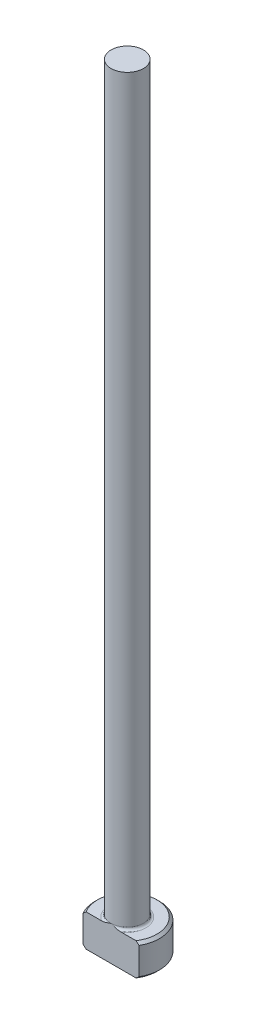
ISO-10303-21;
HEADER;
FILE_DESCRIPTION(('STEP AP214'),'2;1');
FILE_NAME('part.step','',(''),(''),'','','');
FILE_SCHEMA(('AUTOMOTIVE_DESIGN { 1 0 10303 214 1 1 1 1 }'));
ENDSEC;
DATA;
#1=APPLICATION_CONTEXT('core data for automotive mechanical design processes');
#2=APPLICATION_PROTOCOL_DEFINITION('international standard','automotive_design',2000,#1);
#3=PRODUCT_CONTEXT('',#1,'mechanical');
#4=PRODUCT('Part','Part','',(#3));
#5=PRODUCT_RELATED_PRODUCT_CATEGORY('part','',(#4));
#6=PRODUCT_DEFINITION_FORMATION('','',#4);
#7=PRODUCT_DEFINITION_CONTEXT('part definition',#1,'design');
#8=PRODUCT_DEFINITION('design','',#6,#7);
#9=PRODUCT_DEFINITION_SHAPE('','',#8);
#10=(LENGTH_UNIT() NAMED_UNIT(*) SI_UNIT(.MILLI.,.METRE.));
#11=(NAMED_UNIT(*) PLANE_ANGLE_UNIT() SI_UNIT($,.RADIAN.));
#12=(NAMED_UNIT(*) SI_UNIT($,.STERADIAN.) SOLID_ANGLE_UNIT());
#13=UNCERTAINTY_MEASURE_WITH_UNIT(LENGTH_MEASURE(1.E-05),#10,'distance_accuracy_value','');
#14=(GEOMETRIC_REPRESENTATION_CONTEXT(3) GLOBAL_UNCERTAINTY_ASSIGNED_CONTEXT((#13)) GLOBAL_UNIT_ASSIGNED_CONTEXT((#10,
#11,#12)) REPRESENTATION_CONTEXT('',''));
#15=CARTESIAN_POINT('',(0.,0.,0.));
#16=DIRECTION('',(0.,0.,1.));
#17=DIRECTION('',(1.,0.,0.));
#18=AXIS2_PLACEMENT_3D('',#15,#16,#17);
#19=CARTESIAN_POINT('',(0.,0.,0.));
#20=DIRECTION('',(0.,-1.,0.));
#21=DIRECTION('',(0.,0.,-1.));
#22=AXIS2_PLACEMENT_3D('',#19,#20,#21);
#23=PLANE('',#22);
#24=CARTESIAN_POINT('',(0.,0.,0.));
#25=DIRECTION('',(0.,-1.,0.));
#26=DIRECTION('',(0.,0.,-1.));
#27=AXIS2_PLACEMENT_3D('',#24,#25,#26);
#28=CIRCLE('',#27,2.92099999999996);
#29=CARTESIAN_POINT('',(-2.45195529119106,0.,1.58749999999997));
#30=VERTEX_POINT('',#29);
#31=CARTESIAN_POINT('',(2.45195529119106,0.,1.58749999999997));
#32=VERTEX_POINT('',#31);
#33=EDGE_CURVE('E98',#30,#32,#28,.T.);
#34=ORIENTED_EDGE('',*,*,#33,.T.);
#35=DIRECTION('',(-1.,0.,0.));
#36=VECTOR('',#35,1.);
#37=CARTESIAN_POINT('',(-2.74963065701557,0.,1.58749999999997));
#38=LINE('',#37,#36);
#39=EDGE_CURVE('E83',#32,#30,#38,.T.);
#40=ORIENTED_EDGE('',*,*,#39,.T.);
#41=EDGE_LOOP('',(#34,#40));
#42=FACE_BOUND('',#41,.T.);
#43=ADVANCED_FACE('F32',(#42),#23,.T.);
#44=CARTESIAN_POINT('',(0.,259.958771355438,0.));
#45=DIRECTION('',(0.,1.,0.));
#46=DIRECTION('',(0.,0.,1.));
#47=AXIS2_PLACEMENT_3D('',#44,#45,#46);
#48=CYLINDRICAL_SURFACE('',#47,3.17499999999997);
#49=CARTESIAN_POINT('',(0.,2.92099999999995,0.));
#50=DIRECTION('',(0.,1.,0.));
#51=DIRECTION('',(0.,0.,1.));
#52=AXIS2_PLACEMENT_3D('',#49,#50,#51);
#53=CIRCLE('',#52,3.17499999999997);
#54=CARTESIAN_POINT('',(-2.74963065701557,2.92099999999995,1.58749999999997));
#55=VERTEX_POINT('',#54);
#56=CARTESIAN_POINT('',(2.74963065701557,2.92099999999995,1.58749999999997));
#57=VERTEX_POINT('',#56);
#58=EDGE_CURVE('E104',#55,#57,#53,.F.);
#59=ORIENTED_EDGE('',*,*,#58,.T.);
#60=DIRECTION('',(0.,-1.,0.));
#61=VECTOR('',#60,1.);
#62=CARTESIAN_POINT('',(2.74963065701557,76.2,1.58749999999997));
#63=LINE('',#62,#61);
#64=CARTESIAN_POINT('',(2.74963065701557,0.254000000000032,1.58749999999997));
#65=VERTEX_POINT('',#64);
#66=EDGE_CURVE('E183',#57,#65,#63,.T.);
#67=ORIENTED_EDGE('',*,*,#66,.T.);
#68=CARTESIAN_POINT('',(0.,0.254000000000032,0.));
#69=DIRECTION('',(0.,-1.,0.));
#70=DIRECTION('',(0.,0.,-1.));
#71=AXIS2_PLACEMENT_3D('',#68,#69,#70);
#72=CIRCLE('',#71,3.17499999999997);
#73=CARTESIAN_POINT('',(-2.74963065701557,0.254000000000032,1.58749999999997));
#74=VERTEX_POINT('',#73);
#75=EDGE_CURVE('E100',#65,#74,#72,.F.);
#76=ORIENTED_EDGE('',*,*,#75,.T.);
#77=DIRECTION('',(0.,-1.,0.));
#78=VECTOR('',#77,1.);
#79=CARTESIAN_POINT('',(-2.74963065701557,76.2,1.58749999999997));
#80=LINE('',#79,#78);
#81=EDGE_CURVE('E93',#55,#74,#80,.T.);
#82=ORIENTED_EDGE('',*,*,#81,.F.);
#83=EDGE_LOOP('',(#59,#67,#76,#82));
#84=FACE_BOUND('',#83,.T.);
#85=ADVANCED_FACE('F158',(#84),#48,.T.);
#86=CARTESIAN_POINT('',(-3.17499999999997,3.175,0.));
#87=DIRECTION('',(0.,1.,0.));
#88=DIRECTION('',(0.,0.,1.));
#89=AXIS2_PLACEMENT_3D('',#86,#87,#88);
#90=PLANE('',#89);
#91=CARTESIAN_POINT('',(0.,3.175,0.));
#92=DIRECTION('',(0.,1.,0.));
#93=DIRECTION('',(0.,0.,1.));
#94=AXIS2_PLACEMENT_3D('',#91,#92,#93);
#95=CIRCLE('',#94,2.92099999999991);
#96=CARTESIAN_POINT('',(2.45195529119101,3.175,1.58749999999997));
#97=VERTEX_POINT('',#96);
#98=CARTESIAN_POINT('',(-2.45195529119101,3.175,1.58749999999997));
#99=VERTEX_POINT('',#98);
#100=EDGE_CURVE('E178',#97,#99,#95,.T.);
#101=ORIENTED_EDGE('',*,*,#100,.T.);
#102=DIRECTION('',(1.,0.,0.));
#103=VECTOR('',#102,1.);
#104=CARTESIAN_POINT('',(-3.17499999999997,3.175,1.58749999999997));
#105=LINE('',#104,#103);
#106=CARTESIAN_POINT('',(-0.933255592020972,3.17500000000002,1.58749999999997));
#107=VERTEX_POINT('',#106);
#108=EDGE_CURVE('E57',#99,#107,#105,.T.);
#109=ORIENTED_EDGE('',*,*,#108,.T.);
#110=CARTESIAN_POINT('',(0.,3.175,0.));
#111=DIRECTION('',(0.,1.,0.));
#112=DIRECTION('',(0.,0.,1.));
#113=AXIS2_PLACEMENT_3D('',#110,#111,#112);
#114=CIRCLE('',#113,1.84149999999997);
#115=CARTESIAN_POINT('',(0.933255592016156,3.17500000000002,1.58749999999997));
#116=VERTEX_POINT('',#115);
#117=EDGE_CURVE('E107',#107,#116,#114,.F.);
#118=ORIENTED_EDGE('',*,*,#117,.T.);
#119=EDGE_CURVE('E136',#116,#97,#105,.T.);
#120=ORIENTED_EDGE('',*,*,#119,.T.);
#121=EDGE_LOOP('',(#101,#109,#118,#120));
#122=FACE_BOUND('',#121,.T.);
#123=ADVANCED_FACE('F147',(#122),#90,.T.);
#124=CARTESIAN_POINT('',(0.,3.17499999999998,0.));
#125=DIRECTION('',(0.,-1.,0.));
#126=DIRECTION('',(0.,0.,-1.));
#127=AXIS2_PLACEMENT_3D('',#124,#125,#126);
#128=CONICAL_SURFACE('',#127,2.92099999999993,0.78539816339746);
#129=ORIENTED_EDGE('',*,*,#58,.F.);
#130=CARTESIAN_POINT('',(-6.0529050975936,-0.161620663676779,1.58749999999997));
#131=CARTESIAN_POINT('',(-5.91567682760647,-0.028889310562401,1.58749999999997));
#132=CARTESIAN_POINT('',(-5.77831035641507,0.103699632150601,1.58749999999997));
#133=CARTESIAN_POINT('',(-5.50321874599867,0.36850839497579,1.58749999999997));
#134=CARTESIAN_POINT('',(-5.36549360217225,0.500728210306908,1.58749999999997));
#135=CARTESIAN_POINT('',(-5.08953516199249,0.764778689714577,1.58749999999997));
#136=CARTESIAN_POINT('',(-4.95130164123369,0.896609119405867,1.58749999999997));
#137=CARTESIAN_POINT('',(-4.67428233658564,1.15968706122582,1.58749999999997));
#138=CARTESIAN_POINT('',(-4.5354965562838,1.29093457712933,1.58749999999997));
#139=CARTESIAN_POINT('',(-4.2599772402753,1.550077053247,1.58749999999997));
#140=CARTESIAN_POINT('',(-4.12325766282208,1.67798684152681,1.58749999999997));
#141=CARTESIAN_POINT('',(-3.84892898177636,1.9328486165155,1.58749999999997));
#142=CARTESIAN_POINT('',(-3.71131988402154,2.05980060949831,1.58749999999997));
#143=CARTESIAN_POINT('',(-3.43493978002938,2.31237508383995,1.58749999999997));
#144=CARTESIAN_POINT('',(-3.29616903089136,2.4379978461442,1.58749999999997));
#145=CARTESIAN_POINT('',(-3.01699558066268,2.68741369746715,1.58749999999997));
#146=CARTESIAN_POINT('',(-2.8765929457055,2.81120686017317,1.58749999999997));
#147=CARTESIAN_POINT('',(-2.64816703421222,3.0087586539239,1.58749999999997));
#148=CARTESIAN_POINT('',(-2.56087478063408,3.08336151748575,1.58749999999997));
#149=CARTESIAN_POINT('',(-2.38515423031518,3.23123871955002,1.58749999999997));
#150=CARTESIAN_POINT('',(-2.29672582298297,3.30451292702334,1.58749999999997));
#151=CARTESIAN_POINT('',(-2.11747400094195,3.45004422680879,1.58749999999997));
#152=CARTESIAN_POINT('',(-2.02663514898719,3.52228237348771,1.58749999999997));
#153=CARTESIAN_POINT('',(-1.84302524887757,3.664230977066,1.58749999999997));
#154=CARTESIAN_POINT('',(-1.75025467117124,3.73394203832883,1.58749999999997));
#155=CARTESIAN_POINT('',(-1.5606747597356,3.8708063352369,1.58749999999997));
#156=CARTESIAN_POINT('',(-1.46382547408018,3.93790459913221,1.58749999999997));
#157=CARTESIAN_POINT('',(-1.26632594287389,4.06669147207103,1.58749999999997));
#158=CARTESIAN_POINT('',(-1.16567073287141,4.12837264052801,1.58749999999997));
#159=CARTESIAN_POINT('',(-1.01165766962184,4.2140225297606,1.58749999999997));
#160=CARTESIAN_POINT('',(-0.960142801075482,4.24127929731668,1.58749999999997));
#161=CARTESIAN_POINT('',(-0.855780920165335,4.29309798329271,1.58749999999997));
#162=CARTESIAN_POINT('',(-0.802933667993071,4.31765941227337,1.58749999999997));
#163=CARTESIAN_POINT('',(-0.642461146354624,4.38614656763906,1.58749999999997));
#164=CARTESIAN_POINT('',(-0.53251850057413,4.42510149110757,1.58749999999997));
#165=CARTESIAN_POINT('',(-0.367680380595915,4.46726244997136,1.58749999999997));
#166=CARTESIAN_POINT('',(-0.314802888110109,4.47844427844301,1.58749999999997));
#167=CARTESIAN_POINT('',(-0.208209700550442,4.49576654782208,1.58749999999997));
#168=CARTESIAN_POINT('',(-0.154494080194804,4.50190743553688,1.58749999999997));
#169=CARTESIAN_POINT('',(-0.0468792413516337,4.50871296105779,1.58749999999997));
#170=CARTESIAN_POINT('',(0.00701889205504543,4.50939451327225,1.58749999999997));
#171=CARTESIAN_POINT('',(0.114606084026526,4.50527679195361,1.58749999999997));
#172=CARTESIAN_POINT('',(0.168295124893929,4.50047706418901,1.58749999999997));
#173=CARTESIAN_POINT('',(0.274485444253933,4.48579689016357,1.58749999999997));
#174=CARTESIAN_POINT('',(0.326992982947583,4.4759608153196,1.58749999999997));
#175=CARTESIAN_POINT('',(0.430974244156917,4.45181809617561,1.58749999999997));
#176=CARTESIAN_POINT('',(0.482447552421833,4.43750969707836,1.58749999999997));
#177=CARTESIAN_POINT('',(0.584460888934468,4.40502489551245,1.58749999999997));
#178=CARTESIAN_POINT('',(0.634994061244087,4.38682724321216,1.58749999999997));
#179=CARTESIAN_POINT('',(0.73478943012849,4.34729308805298,1.58749999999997));
#180=CARTESIAN_POINT('',(0.784051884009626,4.32595722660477,1.58749999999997));
#181=CARTESIAN_POINT('',(0.93054934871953,4.25791922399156,1.58749999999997));
#182=CARTESIAN_POINT('',(1.02598802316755,4.20736047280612,1.58749999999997));
#183=CARTESIAN_POINT('',(1.21304313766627,4.09955451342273,1.58749999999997));
#184=CARTESIAN_POINT('',(1.30465471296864,4.04229912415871,1.58749999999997));
#185=CARTESIAN_POINT('',(1.48526211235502,3.92308746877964,1.58749999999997));
#186=CARTESIAN_POINT('',(1.57424615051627,3.86111349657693,1.58749999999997));
#187=CARTESIAN_POINT('',(1.7499000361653,3.73408621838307,1.58749999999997));
#188=CARTESIAN_POINT('',(1.83657099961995,3.6690344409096,1.58749999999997));
#189=CARTESIAN_POINT('',(2.0093176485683,3.5358337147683,1.58749999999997));
#190=CARTESIAN_POINT('',(2.09537048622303,3.46765527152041,1.58749999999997));
#191=CARTESIAN_POINT('',(2.26611736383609,3.32960643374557,1.58749999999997));
#192=CARTESIAN_POINT('',(2.3508112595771,3.25973586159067,1.58749999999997));
#193=CARTESIAN_POINT('',(2.60290121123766,3.04858139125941,1.58749999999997));
#194=CARTESIAN_POINT('',(2.76872537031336,2.9054238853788,1.58749999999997));
#195=CARTESIAN_POINT('',(3.06970913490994,2.64069522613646,1.58749999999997));
#196=CARTESIAN_POINT('',(3.20528660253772,2.51959458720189,1.58749999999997));
#197=CARTESIAN_POINT('',(3.475103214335,2.27590400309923,1.58749999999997));
#198=CARTESIAN_POINT('',(3.60934232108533,2.15331401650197,1.58749999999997));
#199=CARTESIAN_POINT('',(3.87695374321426,1.90694239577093,1.58749999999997));
#200=CARTESIAN_POINT('',(4.01032512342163,1.78315974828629,1.58749999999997));
#201=CARTESIAN_POINT('',(4.27630880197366,1.53478104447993,1.58749999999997));
#202=CARTESIAN_POINT('',(4.40892109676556,1.41018498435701,1.58749999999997));
#203=CARTESIAN_POINT('',(4.7949941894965,1.04574684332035,1.58749999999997));
#204=CARTESIAN_POINT('',(5.04767313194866,0.805076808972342,1.58749999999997));
#205=CARTESIAN_POINT('',(5.42550911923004,0.443121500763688,1.58749999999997));
#206=CARTESIAN_POINT('',(5.55118772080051,0.322378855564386,1.58749999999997));
#207=CARTESIAN_POINT('',(5.80225207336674,0.0805914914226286,1.58749999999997));
#208=CARTESIAN_POINT('',(5.92763782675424,-0.0404532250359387,1.58749999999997));
#209=CARTESIAN_POINT('',(6.0529050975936,-0.16162066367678,1.58749999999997));
#210=B_SPLINE_CURVE_WITH_KNOTS('',3,(#130,#131,#132,#133,#134,#135,#136,#137,#138,#139,#140,
#141,#142,#143,#144,#145,#146,#147,#148,#149,#150,#151,#152,#153,#154,#155,#156,#157,#158,#159,
#160,#161,#162,#163,#164,#165,#166,#167,#168,#169,#170,#171,#172,#173,#174,#175,#176,#177,#178,
#179,#180,#181,#182,#183,#184,#185,#186,#187,#188,#189,#190,#191,#192,#193,#194,#195,#196,#197,
#198,#199,#200,#201,#202,#203,#204,#205,#206,#207,#208,#209),.UNSPECIFIED.,.F.,.F.,(4,2,2,2,2,2,
2,2,2,2,2,2,2,2,2,2,2,2,2,2,2,2,2,2,2,2,2,2,2,2,2,2,2,2,2,2,2,2,2,4),(0.,0.57275067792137,
1.14550874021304,1.71856057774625,2.29160869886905,2.85328006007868,3.41494773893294,
3.97649423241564,4.53801804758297,4.88249307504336,5.22700189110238,5.57515326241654,
5.92322081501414,6.27657800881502,6.63041319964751,6.8051812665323,6.97998101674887,
7.32824262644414,7.49018491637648,7.65211285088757,7.81353889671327,7.97497832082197,
8.13501929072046,8.29512313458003,8.4561251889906,8.61709438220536,8.940629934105,
9.26456495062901,9.58978187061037,9.91483894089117,10.2441741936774,10.5735441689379,
11.2306812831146,11.7760337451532,12.3214014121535,12.8672825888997,13.4131663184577,
14.4600164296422,14.9828595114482,15.5056983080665),.UNSPECIFIED.);
#211=EDGE_CURVE('E135',#55,#99,#210,.T.);
#212=ORIENTED_EDGE('',*,*,#211,.T.);
#213=ORIENTED_EDGE('',*,*,#100,.F.);
#214=EDGE_CURVE('E127',#97,#57,#210,.T.);
#215=ORIENTED_EDGE('',*,*,#214,.T.);
#216=EDGE_LOOP('',(#129,#212,#213,#215));
#217=FACE_BOUND('',#216,.T.);
#218=ADVANCED_FACE('F143',(#217),#128,.T.);
#219=CARTESIAN_POINT('',(0.,0.254000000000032,0.));
#220=DIRECTION('',(0.,1.,0.));
#221=DIRECTION('',(0.,0.,1.));
#222=AXIS2_PLACEMENT_3D('',#219,#220,#221);
#223=CONICAL_SURFACE('',#222,3.17499999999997,0.785398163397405);
#224=ORIENTED_EDGE('',*,*,#75,.F.);
#225=CARTESIAN_POINT('',(6.0529050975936,3.3366206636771,1.58749999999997));
#226=CARTESIAN_POINT('',(5.91567682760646,3.2038893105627,1.58749999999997));
#227=CARTESIAN_POINT('',(5.77831035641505,3.07130036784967,1.58749999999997));
#228=CARTESIAN_POINT('',(5.50321874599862,2.80649160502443,1.58749999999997));
#229=CARTESIAN_POINT('',(5.36549360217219,2.67427178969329,1.58749999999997));
#230=CARTESIAN_POINT('',(5.08953516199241,2.41022131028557,1.58749999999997));
#231=CARTESIAN_POINT('',(4.9513016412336,2.27839088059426,1.58749999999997));
#232=CARTESIAN_POINT('',(4.67428233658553,2.01531293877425,1.58749999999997));
#233=CARTESIAN_POINT('',(4.53549655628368,1.88406542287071,1.58749999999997));
#234=CARTESIAN_POINT('',(4.25997724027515,1.62492294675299,1.58749999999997));
#235=CARTESIAN_POINT('',(4.12325766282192,1.49701315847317,1.58749999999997));
#236=CARTESIAN_POINT('',(3.84892898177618,1.24215138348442,1.58749999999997));
#237=CARTESIAN_POINT('',(3.71131988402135,1.1151993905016,1.58749999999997));
#238=CARTESIAN_POINT('',(3.43493978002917,0.862624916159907,1.58749999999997));
#239=CARTESIAN_POINT('',(3.29616903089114,0.737002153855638,1.58749999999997));
#240=CARTESIAN_POINT('',(3.01699558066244,0.487586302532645,1.58749999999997));
#241=CARTESIAN_POINT('',(2.87659294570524,0.363793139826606,1.58749999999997));
#242=CARTESIAN_POINT('',(2.64816703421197,0.16624134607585,1.58749999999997));
#243=CARTESIAN_POINT('',(2.56087478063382,0.0916384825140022,1.58749999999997));
#244=CARTESIAN_POINT('',(2.38515423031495,-0.0562387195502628,1.58749999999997));
#245=CARTESIAN_POINT('',(2.29672582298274,-0.129512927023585,1.58749999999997));
#246=CARTESIAN_POINT('',(2.11747400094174,-0.275044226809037,1.58749999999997));
#247=CARTESIAN_POINT('',(2.02663514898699,-0.34728237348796,1.58749999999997));
#248=CARTESIAN_POINT('',(1.84302524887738,-0.489230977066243,1.58749999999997));
#249=CARTESIAN_POINT('',(1.75025467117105,-0.558942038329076,1.58749999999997));
#250=CARTESIAN_POINT('',(1.56067475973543,-0.695806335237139,1.58749999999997));
#251=CARTESIAN_POINT('',(1.46382547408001,-0.762904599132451,1.58749999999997));
#252=CARTESIAN_POINT('',(1.26632594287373,-0.891691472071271,1.58749999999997));
#253=CARTESIAN_POINT('',(1.16567073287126,-0.953372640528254,1.58749999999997));
#254=CARTESIAN_POINT('',(1.01165766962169,-1.03902252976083,1.58749999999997));
#255=CARTESIAN_POINT('',(0.96014280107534,-1.06627929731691,1.58749999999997));
#256=CARTESIAN_POINT('',(0.855780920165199,-1.11809798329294,1.58749999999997));
#257=CARTESIAN_POINT('',(0.802933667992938,-1.14265941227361,1.58749999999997));
#258=CARTESIAN_POINT('',(0.642461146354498,-1.21114656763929,1.58749999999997));
#259=CARTESIAN_POINT('',(0.532518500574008,-1.2501014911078,1.58749999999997));
#260=CARTESIAN_POINT('',(0.367680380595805,-1.29226244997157,1.58749999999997));
#261=CARTESIAN_POINT('',(0.314802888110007,-1.30344427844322,1.58749999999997));
#262=CARTESIAN_POINT('',(0.208209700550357,-1.32076654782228,1.58749999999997));
#263=CARTESIAN_POINT('',(0.154494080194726,-1.32690743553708,1.58749999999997));
#264=CARTESIAN_POINT('',(0.0468792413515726,-1.33371296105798,1.58749999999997));
#265=CARTESIAN_POINT('',(-0.00701889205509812,-1.33439451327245,1.58749999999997));
#266=CARTESIAN_POINT('',(-0.114606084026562,-1.3302767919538,1.58749999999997));
#267=CARTESIAN_POINT('',(-0.168295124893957,-1.3254770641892,1.58749999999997));
#268=CARTESIAN_POINT('',(-0.274485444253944,-1.31079689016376,1.58749999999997));
#269=CARTESIAN_POINT('',(-0.326992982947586,-1.30096081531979,1.58749999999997));
#270=CARTESIAN_POINT('',(-0.430974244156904,-1.2768180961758,1.58749999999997));
#271=CARTESIAN_POINT('',(-0.482447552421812,-1.26250969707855,1.58749999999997));
#272=CARTESIAN_POINT('',(-0.584460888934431,-1.23002489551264,1.58749999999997));
#273=CARTESIAN_POINT('',(-0.634994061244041,-1.21182724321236,1.58749999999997));
#274=CARTESIAN_POINT('',(-0.734789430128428,-1.17229308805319,1.58749999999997));
#275=CARTESIAN_POINT('',(-0.784051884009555,-1.15095722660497,1.58749999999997));
#276=CARTESIAN_POINT('',(-0.930549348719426,-1.08291922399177,1.58749999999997));
#277=CARTESIAN_POINT('',(-1.02598802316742,-1.03236047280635,1.58749999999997));
#278=CARTESIAN_POINT('',(-1.21304313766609,-0.924554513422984,1.58749999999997));
#279=CARTESIAN_POINT('',(-1.30465471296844,-0.867299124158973,1.58749999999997));
#280=CARTESIAN_POINT('',(-1.48526211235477,-0.748087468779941,1.58749999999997));
#281=CARTESIAN_POINT('',(-1.574246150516,-0.686113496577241,1.58749999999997));
#282=CARTESIAN_POINT('',(-1.74990003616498,-0.559086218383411,1.58749999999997));
#283=CARTESIAN_POINT('',(-1.83657099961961,-0.494034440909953,1.58749999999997));
#284=CARTESIAN_POINT('',(-2.00931764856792,-0.360833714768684,1.58749999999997));
#285=CARTESIAN_POINT('',(-2.09537048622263,-0.292655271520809,1.58749999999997));
#286=CARTESIAN_POINT('',(-2.26611736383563,-0.154606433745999,1.58749999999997));
#287=CARTESIAN_POINT('',(-2.35081125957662,-0.0847358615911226,1.58749999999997));
#288=CARTESIAN_POINT('',(-2.60290121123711,0.126418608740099,1.58749999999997));
#289=CARTESIAN_POINT('',(-2.76872537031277,0.26957611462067,1.58749999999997));
#290=CARTESIAN_POINT('',(-3.06970913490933,0.534304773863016,1.58749999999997));
#291=CARTESIAN_POINT('',(-3.20528660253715,0.655405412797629,1.58749999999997));
#292=CARTESIAN_POINT('',(-3.47510321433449,0.89909599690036,1.58749999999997));
#293=CARTESIAN_POINT('',(-3.60934232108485,1.02168598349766,1.58749999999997));
#294=CARTESIAN_POINT('',(-3.87695374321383,1.26805760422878,1.58749999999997));
#295=CARTESIAN_POINT('',(-4.01032512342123,1.39184025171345,1.58749999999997));
#296=CARTESIAN_POINT('',(-4.27630880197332,1.64021895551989,1.58749999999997));
#297=CARTESIAN_POINT('',(-4.40892109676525,1.76481501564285,1.58749999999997));
#298=CARTESIAN_POINT('',(-4.79499418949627,2.12925315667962,1.58749999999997));
#299=CARTESIAN_POINT('',(-5.04767313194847,2.3699231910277,1.58749999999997));
#300=CARTESIAN_POINT('',(-5.42550911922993,2.73187849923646,1.58749999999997));
#301=CARTESIAN_POINT('',(-5.55118772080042,2.8526211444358,1.58749999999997));
#302=CARTESIAN_POINT('',(-5.80225207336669,3.09440850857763,1.58749999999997));
#303=CARTESIAN_POINT('',(-5.92763782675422,3.21545322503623,1.58749999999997));
#304=CARTESIAN_POINT('',(-6.0529050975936,3.33662066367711,1.58749999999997));
#305=B_SPLINE_CURVE_WITH_KNOTS('',3,(#225,#226,#227,#228,#229,#230,#231,#232,#233,#234,#235,
#236,#237,#238,#239,#240,#241,#242,#243,#244,#245,#246,#247,#248,#249,#250,#251,#252,#253,#254,
#255,#256,#257,#258,#259,#260,#261,#262,#263,#264,#265,#266,#267,#268,#269,#270,#271,#272,#273,
#274,#275,#276,#277,#278,#279,#280,#281,#282,#283,#284,#285,#286,#287,#288,#289,#290,#291,#292,
#293,#294,#295,#296,#297,#298,#299,#300,#301,#302,#303,#304),.UNSPECIFIED.,.F.,.F.,(4,2,2,2,2,2,
2,2,2,2,2,2,2,2,2,2,2,2,2,2,2,2,2,2,2,2,2,2,2,2,2,2,2,2,2,2,2,2,2,4),(0.,0.572750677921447,
1.1455087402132,1.71856057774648,2.29160869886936,2.85328006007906,3.41494773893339,
3.97649423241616,4.53801804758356,4.88249307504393,5.22700189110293,5.57515326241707,
5.92322081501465,6.27657800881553,6.630413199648,6.80518126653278,6.97998101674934,
7.3282426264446,7.49018491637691,7.65211285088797,7.81353889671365,7.97497832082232,
8.13501929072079,8.29512313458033,8.45612518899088,8.61709438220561,8.94062993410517,
9.2645649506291,9.58978187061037,9.9148389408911,10.2441741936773,10.5735441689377,
11.2306812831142,11.7760337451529,12.3214014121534,12.8672825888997,13.4131663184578,
14.4600164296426,14.9828595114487,15.5056983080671),.UNSPECIFIED.);
#306=EDGE_CURVE('E86',#65,#32,#305,.T.);
#307=ORIENTED_EDGE('',*,*,#306,.T.);
#308=ORIENTED_EDGE('',*,*,#33,.F.);
#309=EDGE_CURVE('E89',#30,#74,#305,.T.);
#310=ORIENTED_EDGE('',*,*,#309,.T.);
#311=EDGE_LOOP('',(#224,#307,#308,#310));
#312=FACE_BOUND('',#311,.T.);
#313=ADVANCED_FACE('F97',(#312),#223,.T.);
#314=CARTESIAN_POINT('',(0.,3.42900000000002,0.));
#315=DIRECTION('',(0.,1.,0.));
#316=DIRECTION('',(0.,0.,1.));
#317=AXIS2_PLACEMENT_3D('',#314,#315,#316);
#318=TOROIDAL_SURFACE('',#317,1.84149999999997,0.254);
#319=CARTESIAN_POINT('',(0.,3.42900000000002,1.58749999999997));
#320=CARTESIAN_POINT('',(1.92205032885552E-10,3.42900057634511,1.58749999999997));
#321=CARTESIAN_POINT('',(1.22611616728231E-07,3.42900115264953,1.58749999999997));
#322=CARTESIAN_POINT('',(5.09676370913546E-07,3.42900226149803,1.58749999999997));
#323=CARTESIAN_POINT('',(7.78176335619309E-07,3.42900279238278,1.58749999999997));
#324=CARTESIAN_POINT('',(1.42307273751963E-06,3.42900385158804,1.58749999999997));
#325=CARTESIAN_POINT('',(1.8071386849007E-06,3.42900437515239,1.58749999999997));
#326=CARTESIAN_POINT('',(2.63494847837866E-06,3.42900536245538,1.58749999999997));
#327=CARTESIAN_POINT('',(3.07814758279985E-06,3.42900582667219,1.58749999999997));
#328=CARTESIAN_POINT('',(4.66897360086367E-06,3.42900738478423,1.58749999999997));
#329=CARTESIAN_POINT('',(5.89404911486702E-06,3.42900840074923,1.58749999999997));
#330=CARTESIAN_POINT('',(8.42427515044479E-06,3.42901020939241,1.58749999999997));
#331=CARTESIAN_POINT('',(9.72480578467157E-06,3.42901100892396,1.58749999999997));
#332=CARTESIAN_POINT('',(1.48060602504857E-05,3.42901401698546,1.58749999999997));
#333=CARTESIAN_POINT('',(1.86838282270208E-05,3.42901606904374,1.58749999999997));
#334=CARTESIAN_POINT('',(2.63261118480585E-05,3.42901942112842,1.58749999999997));
#335=CARTESIAN_POINT('',(3.00687418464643E-05,3.42902077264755,1.58749999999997));
#336=CARTESIAN_POINT('',(4.60276300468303E-05,3.42902652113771,1.58749999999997));
#337=CARTESIAN_POINT('',(5.82470200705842E-05,3.4290308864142,1.58749999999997));
#338=CARTESIAN_POINT('',(8.11070099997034E-05,3.42903788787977,1.58749999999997));
#339=CARTESIAN_POINT('',(9.16953117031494E-05,3.42904068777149,1.58749999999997));
#340=CARTESIAN_POINT('',(0.000168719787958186,3.42906287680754,1.58749999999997));
#341=CARTESIAN_POINT('',(0.000232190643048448,3.42909118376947,1.58749999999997));
#342=CARTESIAN_POINT('',(0.000479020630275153,3.4291972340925,1.58749999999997));
#343=CARTESIAN_POINT('',(0.000664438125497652,3.42926834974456,1.58749999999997));
#344=CARTESIAN_POINT('',(0.00138448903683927,3.42954862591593,1.58749999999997));
#345=CARTESIAN_POINT('',(0.00191701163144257,3.42976473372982,1.58749999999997));
#346=CARTESIAN_POINT('',(0.00409774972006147,3.43064550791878,1.58749999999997));
#347=CARTESIAN_POINT('',(0.00574830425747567,3.43130231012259,1.58749999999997));
#348=CARTESIAN_POINT('',(0.0289985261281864,3.44055947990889,1.58749999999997));
#349=CARTESIAN_POINT('',(0.0505816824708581,3.44921674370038,1.58749999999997));
#350=CARTESIAN_POINT('',(0.0929947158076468,3.46610702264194,1.58749999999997));
#351=CARTESIAN_POINT('',(0.113823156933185,3.47434394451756,1.58749999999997));
#352=CARTESIAN_POINT('',(0.157956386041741,3.49164606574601,1.58749999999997));
#353=CARTESIAN_POINT('',(0.181267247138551,3.50069608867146,1.58749999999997));
#354=CARTESIAN_POINT('',(0.228222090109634,3.5186322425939,1.58749999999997));
#355=CARTESIAN_POINT('',(0.251867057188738,3.52751579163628,1.58749999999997));
#356=CARTESIAN_POINT('',(0.310512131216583,3.54905503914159,1.58749999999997));
#357=CARTESIAN_POINT('',(0.345588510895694,3.56150550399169,1.58749999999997));
#358=CARTESIAN_POINT('',(0.415278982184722,3.58503024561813,1.58749999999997));
#359=CARTESIAN_POINT('',(0.44988436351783,3.59613012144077,1.58749999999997));
#360=CARTESIAN_POINT('',(0.524471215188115,3.61841679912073,1.58749999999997));
#361=CARTESIAN_POINT('',(0.564517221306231,3.62939137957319,1.58749999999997));
#362=CARTESIAN_POINT('',(0.645529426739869,3.64897465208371,1.58749999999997));
#363=CARTESIAN_POINT('',(0.686500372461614,3.6575641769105,1.58749999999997));
#364=CARTESIAN_POINT('',(0.771546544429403,3.67188287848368,1.58749999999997));
#365=CARTESIAN_POINT('',(0.815658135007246,3.67740449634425,1.58749999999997));
#366=CARTESIAN_POINT('',(0.904117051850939,3.68344603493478,1.58749999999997));
#367=CARTESIAN_POINT('',(0.948462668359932,3.68398638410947,1.58749999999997));
#368=CARTESIAN_POINT('',(1.02531896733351,3.67901051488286,1.58749999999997));
#369=CARTESIAN_POINT('',(1.05792141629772,3.67502604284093,1.58749999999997));
#370=CARTESIAN_POINT('',(1.12184393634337,3.66230832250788,1.58749999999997));
#371=CARTESIAN_POINT('',(1.15317534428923,3.65363950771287,1.58749999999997));
#372=CARTESIAN_POINT('',(1.19946468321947,3.63563847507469,1.58749999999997));
#373=CARTESIAN_POINT('',(1.21526783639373,3.62848492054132,1.58749999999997));
#374=CARTESIAN_POINT('',(1.24583726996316,3.61212937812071,1.58749999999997));
#375=CARTESIAN_POINT('',(1.26060215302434,3.60292469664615,1.58749999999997));
#376=CARTESIAN_POINT('',(1.2857581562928,3.5842151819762,1.58749999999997));
#377=CARTESIAN_POINT('',(1.2964438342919,3.57510998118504,1.58749999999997));
#378=CARTESIAN_POINT('',(1.31623154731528,3.55531539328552,1.58749999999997));
#379=CARTESIAN_POINT('',(1.32533681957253,3.5446293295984,1.58749999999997));
#380=CARTESIAN_POINT('',(1.33941140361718,3.52450022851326,1.58749999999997));
#381=CARTESIAN_POINT('',(1.34484814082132,3.51538553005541,1.58749999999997));
#382=CARTESIAN_POINT('',(1.35416329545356,3.49638544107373,1.58749999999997));
#383=CARTESIAN_POINT('',(1.35804267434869,3.48650053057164,1.58749999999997));
#384=CARTESIAN_POINT('',(1.36398436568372,3.46611321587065,1.58749999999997));
#385=CARTESIAN_POINT('',(1.3660335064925,3.45560690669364,1.58749999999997));
#386=CARTESIAN_POINT('',(1.3680840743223,3.43439627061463,1.58749999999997));
#387=CARTESIAN_POINT('',(1.36808648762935,3.42369204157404,1.58749999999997));
#388=CARTESIAN_POINT('',(1.36616208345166,3.40366716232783,1.58749999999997));
#389=CARTESIAN_POINT('',(1.36444960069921,3.39432493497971,1.58749999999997));
#390=CARTESIAN_POINT('',(1.35953338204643,3.37604480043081,1.58749999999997));
#391=CARTESIAN_POINT('',(1.3563294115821,3.36710695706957,1.58749999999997));
#392=CARTESIAN_POINT('',(1.34848006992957,3.34949697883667,1.58749999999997));
#393=CARTESIAN_POINT('',(1.3437857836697,3.34084688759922,1.58749999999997));
#394=CARTESIAN_POINT('',(1.3332444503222,3.32428742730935,1.58749999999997));
#395=CARTESIAN_POINT('',(1.32739692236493,3.31637836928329,1.58749999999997));
#396=CARTESIAN_POINT('',(1.31107304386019,3.2969287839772,1.58749999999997));
#397=CARTESIAN_POINT('',(1.29989286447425,3.28597778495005,1.58749999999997));
#398=CARTESIAN_POINT('',(1.275935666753,3.26597490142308,1.58749999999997));
#399=CARTESIAN_POINT('',(1.2631537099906,3.25692913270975,1.58749999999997));
#400=CARTESIAN_POINT('',(1.22930733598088,3.23613976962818,1.58749999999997));
#401=CARTESIAN_POINT('',(1.2075109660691,3.22559415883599,1.58749999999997));
#402=CARTESIAN_POINT('',(1.16266144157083,3.20795356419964,1.58749999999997));
#403=CARTESIAN_POINT('',(1.13960937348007,3.20085564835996,1.58749999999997));
#404=CARTESIAN_POINT('',(1.07603916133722,3.18534571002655,1.58749999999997));
#405=CARTESIAN_POINT('',(1.03486686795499,3.17965078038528,1.58749999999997));
#406=CARTESIAN_POINT('',(0.951558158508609,3.1741711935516,1.58749999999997));
#407=CARTESIAN_POINT('',(0.909417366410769,3.17449023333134,1.58749999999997));
#408=CARTESIAN_POINT('',(0.811383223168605,3.18054602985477,1.58749999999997));
#409=CARTESIAN_POINT('',(0.755610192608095,3.18806126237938,1.58749999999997));
#410=CARTESIAN_POINT('',(0.644937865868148,3.20866626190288,1.58749999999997));
#411=CARTESIAN_POINT('',(0.5900436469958,3.22178102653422,1.58749999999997));
#412=CARTESIAN_POINT('',(0.485757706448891,3.25059077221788,1.58749999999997));
#413=CARTESIAN_POINT('',(0.436281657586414,3.26598903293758,1.58749999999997));
#414=CARTESIAN_POINT('',(0.338551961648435,3.29877502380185,1.58749999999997));
#415=CARTESIAN_POINT('',(0.290291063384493,3.31614156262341,1.58749999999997));
#416=CARTESIAN_POINT('',(0.225557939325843,3.34039762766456,1.58749999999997));
#417=CARTESIAN_POINT('',(0.208874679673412,3.3467358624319,1.58749999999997));
#418=CARTESIAN_POINT('',(0.175123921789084,3.35969957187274,1.58749999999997));
#419=CARTESIAN_POINT('',(0.158057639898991,3.36632823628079,1.58749999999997));
#420=CARTESIAN_POINT('',(0.117638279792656,3.38214476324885,1.58749999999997));
#421=CARTESIAN_POINT('',(0.0943002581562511,3.39137029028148,1.58749999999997));
#422=CARTESIAN_POINT('',(0.0497824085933,3.40910304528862,1.58749999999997));
#423=CARTESIAN_POINT('',(0.0285986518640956,3.41759960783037,1.58749999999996));
#424=CARTESIAN_POINT('',(0.0057516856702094,3.42669635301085,1.58749999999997));
#425=CARTESIAN_POINT('',(0.00410451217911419,3.42735181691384,1.58749999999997));
#426=CARTESIAN_POINT('',(0.00192459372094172,3.42823223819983,1.58749999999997));
#427=CARTESIAN_POINT('',(0.00138952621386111,3.42844937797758,1.58749999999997));
#428=CARTESIAN_POINT('',(0.000666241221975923,3.42873091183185,1.58749999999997));
#429=CARTESIAN_POINT('',(0.000480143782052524,3.42880228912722,1.58749999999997));
#430=CARTESIAN_POINT('',(0.000232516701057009,3.42890868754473,1.58749999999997));
#431=CARTESIAN_POINT('',(0.000168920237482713,3.42893705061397,1.58749999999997));
#432=CARTESIAN_POINT('',(9.17527164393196E-05,3.42895927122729,1.58749999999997));
#433=CARTESIAN_POINT('',(8.11550295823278E-05,3.42896207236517,1.58749999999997));
#434=CARTESIAN_POINT('',(5.82743950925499E-05,3.42896908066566,1.58749999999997));
#435=CARTESIAN_POINT('',(4.60440003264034E-05,3.42897345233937,1.58749999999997));
#436=CARTESIAN_POINT('',(3.00727683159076E-05,3.42897920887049,1.58749999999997));
#437=CARTESIAN_POINT('',(2.63286808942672E-05,3.42898056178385,1.58749999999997));
#438=CARTESIAN_POINT('',(1.86836530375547E-05,3.42898391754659,1.58749999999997));
#439=CARTESIAN_POINT('',(1.48046518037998E-05,3.42898597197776,1.58749999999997));
#440=CARTESIAN_POINT('',(9.72223947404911E-06,3.42898898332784,1.58749999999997));
#441=CARTESIAN_POINT('',(8.42159652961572E-06,3.42898978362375,1.58749999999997));
#442=CARTESIAN_POINT('',(5.89129732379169E-06,3.4289915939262,1.58749999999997));
#443=CARTESIAN_POINT('',(4.66626869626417E-06,3.42899261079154,1.58749999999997));
#444=CARTESIAN_POINT('',(3.07568805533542E-06,3.42899417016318,1.58749999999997));
#445=CARTESIAN_POINT('',(2.63259567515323E-06,3.42899463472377,1.58749999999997));
#446=CARTESIAN_POINT('',(1.80506087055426E-06,3.42899562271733,1.58749999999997));
#447=CARTESIAN_POINT('',(1.42116389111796E-06,3.42899614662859,1.58749999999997));
#448=CARTESIAN_POINT('',(7.7667565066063E-07,3.42899720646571,1.58749999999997));
#449=CARTESIAN_POINT('',(5.08406493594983E-07,3.42899773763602,1.58749999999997));
#450=CARTESIAN_POINT('',(1.2190188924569E-07,3.4289988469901,1.58749999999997));
#451=CARTESIAN_POINT('',(-1.92251562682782E-10,3.4289994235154,1.58749999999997));
#452=CARTESIAN_POINT('',(0.,3.42900000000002,1.58749999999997));
#453=B_SPLINE_CURVE_WITH_KNOTS('',3,(#319,#320,#321,#322,#323,#324,#325,#326,#327,#328,#329,
#330,#331,#332,#333,#334,#335,#336,#337,#338,#339,#340,#341,#342,#343,#344,#345,#346,#347,#348,
#349,#350,#351,#352,#353,#354,#355,#356,#357,#358,#359,#360,#361,#362,#363,#364,#365,#366,#367,
#368,#369,#370,#371,#372,#373,#374,#375,#376,#377,#378,#379,#380,#381,#382,#383,#384,#385,#386,
#387,#388,#389,#390,#391,#392,#393,#394,#395,#396,#397,#398,#399,#400,#401,#402,#403,#404,#405,
#406,#407,#408,#409,#410,#411,#412,#413,#414,#415,#416,#417,#418,#419,#420,#421,#422,#423,#424,
#425,#426,#427,#428,#429,#430,#431,#432,#433,#434,#435,#436,#437,#438,#439,#440,#441,#442,#443,
#444,#445,#446,#447,#448,#449,#450,#451,#452),.UNSPECIFIED.,.T.,.F.,(4,2,2,2,2,2,2,2,2,2,2,2,2,
2,2,2,2,2,2,2,2,2,2,2,2,2,2,2,2,2,2,2,2,2,2,2,2,2,2,2,2,2,2,2,2,2,2,2,2,2,2,2,2,2,2,2,2,2,2,2,2,
2,2,2,2,2,4),(0.,1.72815455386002E-06,3.50429249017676E-06,5.44430995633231E-06,
7.3675523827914E-06,1.21190895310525E-05,1.66953773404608E-05,2.98160398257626E-05,
4.17409561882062E-05,8.0660475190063E-05,0.000113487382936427,0.000321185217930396,
0.00091759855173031,0.00264089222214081,0.00797105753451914,0.0777276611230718,
0.144923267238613,0.219939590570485,0.295714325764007,0.407362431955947,0.516367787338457,
0.640878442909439,0.766362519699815,0.899536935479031,1.03216495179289,1.13045740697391,
1.22743103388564,1.27935899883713,1.33135556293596,1.37333248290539,1.41522237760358,
1.44693946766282,1.47863694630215,1.51056074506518,1.54246916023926,1.57083210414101,
1.59919951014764,1.62861579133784,1.65804436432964,1.70472658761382,1.75155645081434,
1.82378709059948,1.89595619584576,2.01995471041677,2.14609321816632,2.31447224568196,
2.48361094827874,2.63898919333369,2.79283011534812,2.84637031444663,2.90129461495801,
2.97658236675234,3.04504771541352,3.05036697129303,3.0520984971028,3.0526970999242,
3.05290520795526,3.05293806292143,3.05297701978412,3.05298895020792,3.05300207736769,
3.05300665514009,3.0530114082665,3.05301333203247,3.0530152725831,3.05301704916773,
3.05301877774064),.UNSPECIFIED.);
#454=CARTESIAN_POINT('',(0.,3.42900000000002,1.58749999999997));
#455=VERTEX_POINT('',#454);
#456=EDGE_CURVE('E11',#116,#455,#453,.T.);
#457=ORIENTED_EDGE('',*,*,#456,.F.);
#458=ORIENTED_EDGE('',*,*,#117,.F.);
#459=CARTESIAN_POINT('',(0.,3.42900000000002,1.58749999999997));
#460=CARTESIAN_POINT('',(-1.92205418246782E-10,3.42899942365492,1.58749999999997));
#461=CARTESIAN_POINT('',(-1.22611617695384E-07,3.4289988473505,1.58749999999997));
#462=CARTESIAN_POINT('',(-5.09676372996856E-07,3.428997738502,1.58749999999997));
#463=CARTESIAN_POINT('',(-7.7817633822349E-07,3.42899720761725,1.58749999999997));
#464=CARTESIAN_POINT('',(-1.42307274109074E-06,3.428996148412,1.58749999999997));
#465=CARTESIAN_POINT('',(-1.80713868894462E-06,3.42899562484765,1.58749999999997));
#466=CARTESIAN_POINT('',(-2.63494848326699E-06,3.42899463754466,1.58749999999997));
#467=CARTESIAN_POINT('',(-3.07814758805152E-06,3.42899417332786,1.58749999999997));
#468=CARTESIAN_POINT('',(-4.66897360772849E-06,3.42899261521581,1.58749999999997));
#469=CARTESIAN_POINT('',(-5.89404912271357E-06,3.42899159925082,1.58749999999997));
#470=CARTESIAN_POINT('',(-8.4242751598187E-06,3.42898979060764,1.58749999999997));
#471=CARTESIAN_POINT('',(-9.72480579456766E-06,3.4289889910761,1.58749999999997));
#472=CARTESIAN_POINT('',(-1.4806060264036E-05,3.4289859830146,1.58749999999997));
#473=CARTESIAN_POINT('',(-1.86838282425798E-05,3.42898393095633,1.58749999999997));
#474=CARTESIAN_POINT('',(-2.63261118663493E-05,3.42898057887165,1.58749999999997));
#475=CARTESIAN_POINT('',(-3.00687418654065E-05,3.42897922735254,1.58749999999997));
#476=CARTESIAN_POINT('',(-4.60276300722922E-05,3.42897347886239,1.58749999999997));
#477=CARTESIAN_POINT('',(-5.82470201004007E-05,3.42896911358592,1.58749999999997));
#478=CARTESIAN_POINT('',(-8.11070100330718E-05,3.42896211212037,1.58749999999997));
#479=CARTESIAN_POINT('',(-9.16953117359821E-05,3.42895931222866,1.58749999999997));
#480=CARTESIAN_POINT('',(-0.000168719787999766,3.42893712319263,1.58749999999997));
#481=CARTESIAN_POINT('',(-0.000232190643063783,3.42890881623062,1.58749999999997));
#482=CARTESIAN_POINT('',(-0.000479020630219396,3.42880276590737,1.58749999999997));
#483=CARTESIAN_POINT('',(-0.000664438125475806,3.42873165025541,1.58749999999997));
#484=CARTESIAN_POINT('',(-0.00138448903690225,3.42845137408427,1.58749999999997));
#485=CARTESIAN_POINT('',(-0.00191701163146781,3.42823526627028,1.58749999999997));
#486=CARTESIAN_POINT('',(-0.00409774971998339,3.42735449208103,1.58749999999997));
#487=CARTESIAN_POINT('',(-0.00574830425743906,3.42669768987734,1.58749999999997));
#488=CARTESIAN_POINT('',(-0.0289985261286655,3.41744052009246,1.58749999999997));
#489=CARTESIAN_POINT('',(-0.0505816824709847,3.4087832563,1.58749999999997));
#490=CARTESIAN_POINT('',(-0.0929947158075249,3.39189297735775,1.58749999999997));
#491=CARTESIAN_POINT('',(-0.113823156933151,3.38365605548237,1.58749999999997));
#492=CARTESIAN_POINT('',(-0.157956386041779,3.36635393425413,1.58749999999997));
#493=CARTESIAN_POINT('',(-0.181267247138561,3.3573039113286,1.58749999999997));
#494=CARTESIAN_POINT('',(-0.228222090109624,3.3393677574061,1.58749999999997));
#495=CARTESIAN_POINT('',(-0.251867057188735,3.33048420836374,1.58749999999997));
#496=CARTESIAN_POINT('',(-0.310512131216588,3.30894496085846,1.58749999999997));
#497=CARTESIAN_POINT('',(-0.345588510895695,3.29649449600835,1.58749999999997));
#498=CARTESIAN_POINT('',(-0.415278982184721,3.27296975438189,1.58749999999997));
#499=CARTESIAN_POINT('',(-0.449884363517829,3.26186987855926,1.58749999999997));
#500=CARTESIAN_POINT('',(-0.524471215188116,3.2395832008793,1.58749999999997));
#501=CARTESIAN_POINT('',(-0.564517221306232,3.22860862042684,1.58749999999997));
#502=CARTESIAN_POINT('',(-0.645529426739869,3.20902534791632,1.58749999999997));
#503=CARTESIAN_POINT('',(-0.686500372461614,3.20043582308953,1.58749999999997));
#504=CARTESIAN_POINT('',(-0.771546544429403,3.18611712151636,1.58749999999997));
#505=CARTESIAN_POINT('',(-0.815658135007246,3.18059550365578,1.58749999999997));
#506=CARTESIAN_POINT('',(-0.904117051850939,3.17455396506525,1.58749999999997));
#507=CARTESIAN_POINT('',(-0.948462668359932,3.17401361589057,1.58749999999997));
#508=CARTESIAN_POINT('',(-1.02531896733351,3.17898948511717,1.58749999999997));
#509=CARTESIAN_POINT('',(-1.05792141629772,3.1829739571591,1.58749999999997));
#510=CARTESIAN_POINT('',(-1.12184393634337,3.19569167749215,1.58749999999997));
#511=CARTESIAN_POINT('',(-1.15317534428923,3.20436049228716,1.58749999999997));
#512=CARTESIAN_POINT('',(-1.19946468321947,3.22236152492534,1.58749999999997));
#513=CARTESIAN_POINT('',(-1.21526783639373,3.22951507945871,1.58749999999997));
#514=CARTESIAN_POINT('',(-1.24583726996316,3.24587062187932,1.58749999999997));
#515=CARTESIAN_POINT('',(-1.26060215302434,3.25507530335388,1.58749999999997));
#516=CARTESIAN_POINT('',(-1.2857581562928,3.27378481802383,1.58749999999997));
#517=CARTESIAN_POINT('',(-1.2964438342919,3.28289001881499,1.58749999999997));
#518=CARTESIAN_POINT('',(-1.31623154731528,3.30268460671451,1.58749999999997));
#519=CARTESIAN_POINT('',(-1.32533681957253,3.31337067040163,1.58749999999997));
#520=CARTESIAN_POINT('',(-1.33941140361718,3.33349977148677,1.58749999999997));
#521=CARTESIAN_POINT('',(-1.34484814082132,3.34261446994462,1.58749999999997));
#522=CARTESIAN_POINT('',(-1.35416329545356,3.3616145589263,1.58749999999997));
#523=CARTESIAN_POINT('',(-1.35804267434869,3.37149946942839,1.58749999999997));
#524=CARTESIAN_POINT('',(-1.36398436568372,3.39188678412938,1.58749999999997));
#525=CARTESIAN_POINT('',(-1.3660335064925,3.40239309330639,1.58749999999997));
#526=CARTESIAN_POINT('',(-1.3680840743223,3.4236037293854,1.58749999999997));
#527=CARTESIAN_POINT('',(-1.36808648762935,3.43430795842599,1.58749999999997));
#528=CARTESIAN_POINT('',(-1.36616208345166,3.4543328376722,1.58749999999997));
#529=CARTESIAN_POINT('',(-1.36444960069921,3.46367506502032,1.58749999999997));
#530=CARTESIAN_POINT('',(-1.35953338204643,3.48195519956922,1.58749999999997));
#531=CARTESIAN_POINT('',(-1.3563294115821,3.49089304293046,1.58749999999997));
#532=CARTESIAN_POINT('',(-1.34848006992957,3.50850302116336,1.58749999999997));
#533=CARTESIAN_POINT('',(-1.3437857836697,3.51715311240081,1.58749999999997));
#534=CARTESIAN_POINT('',(-1.3332444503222,3.53371257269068,1.58749999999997));
#535=CARTESIAN_POINT('',(-1.32739692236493,3.54162163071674,1.58749999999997));
#536=CARTESIAN_POINT('',(-1.31107304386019,3.56107121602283,1.58749999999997));
#537=CARTESIAN_POINT('',(-1.29989286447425,3.57202221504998,1.58749999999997));
#538=CARTESIAN_POINT('',(-1.275935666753,3.59202509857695,1.58749999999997));
#539=CARTESIAN_POINT('',(-1.2631537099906,3.60107086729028,1.58749999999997));
#540=CARTESIAN_POINT('',(-1.22930733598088,3.62186023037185,1.58749999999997));
#541=CARTESIAN_POINT('',(-1.2075109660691,3.63240584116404,1.58749999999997));
#542=CARTESIAN_POINT('',(-1.16266144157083,3.6500464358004,1.58749999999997));
#543=CARTESIAN_POINT('',(-1.13960937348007,3.65714435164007,1.58749999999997));
#544=CARTESIAN_POINT('',(-1.07603916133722,3.67265428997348,1.58749999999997));
#545=CARTESIAN_POINT('',(-1.03486686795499,3.67834921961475,1.58749999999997));
#546=CARTESIAN_POINT('',(-0.951558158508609,3.68382880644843,1.58749999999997));
#547=CARTESIAN_POINT('',(-0.909417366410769,3.68350976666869,1.58749999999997));
#548=CARTESIAN_POINT('',(-0.811383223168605,3.67745397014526,1.58749999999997));
#549=CARTESIAN_POINT('',(-0.755610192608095,3.66993873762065,1.58749999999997));
#550=CARTESIAN_POINT('',(-0.644937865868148,3.64933373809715,1.58749999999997));
#551=CARTESIAN_POINT('',(-0.5900436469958,3.63621897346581,1.58749999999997));
#552=CARTESIAN_POINT('',(-0.485757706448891,3.60740922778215,1.58749999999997));
#553=CARTESIAN_POINT('',(-0.436281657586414,3.59201096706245,1.58749999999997));
#554=CARTESIAN_POINT('',(-0.338551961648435,3.55922497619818,1.58749999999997));
#555=CARTESIAN_POINT('',(-0.290291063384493,3.54185843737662,1.58749999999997));
#556=CARTESIAN_POINT('',(-0.225557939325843,3.51760237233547,1.58749999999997));
#557=CARTESIAN_POINT('',(-0.208874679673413,3.51126413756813,1.58749999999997));
#558=CARTESIAN_POINT('',(-0.175123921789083,3.49830042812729,1.58749999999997));
#559=CARTESIAN_POINT('',(-0.15805763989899,3.49167176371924,1.58749999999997));
#560=CARTESIAN_POINT('',(-0.117638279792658,3.47585523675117,1.58749999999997));
#561=CARTESIAN_POINT('',(-0.0943002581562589,3.46662970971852,1.58749999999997));
#562=CARTESIAN_POINT('',(-0.0497824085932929,3.44889695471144,1.58749999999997));
#563=CARTESIAN_POINT('',(-0.02859865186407,3.44040039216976,1.58749999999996));
#564=CARTESIAN_POINT('',(-0.00575168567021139,3.43130364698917,1.58749999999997));
#565=CARTESIAN_POINT('',(-0.00410451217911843,3.43064818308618,1.58749999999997));
#566=CARTESIAN_POINT('',(-0.00192459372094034,3.42976776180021,1.58749999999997));
#567=CARTESIAN_POINT('',(-0.00138952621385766,3.42955062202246,1.58749999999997));
#568=CARTESIAN_POINT('',(-0.000666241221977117,3.42926908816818,1.58749999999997));
#569=CARTESIAN_POINT('',(-0.000480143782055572,3.4291977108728,1.58749999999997));
#570=CARTESIAN_POINT('',(-0.000232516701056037,3.4290913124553,1.58749999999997));
#571=CARTESIAN_POINT('',(-0.000168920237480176,3.42906294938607,1.58749999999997));
#572=CARTESIAN_POINT('',(-9.17527164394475E-05,3.42904072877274,1.58749999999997));
#573=CARTESIAN_POINT('',(-8.11550295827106E-05,3.42903792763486,1.58749999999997));
#574=CARTESIAN_POINT('',(-5.82743950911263E-05,3.42903091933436,1.58749999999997));
#575=CARTESIAN_POINT('',(-4.60440003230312E-05,3.42902654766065,1.58749999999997));
#576=CARTESIAN_POINT('',(-3.00727683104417E-05,3.42902079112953,1.58749999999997));
#577=CARTESIAN_POINT('',(-2.63286808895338E-05,3.42901943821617,1.58749999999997));
#578=CARTESIAN_POINT('',(-1.86836530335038E-05,3.42901608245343,1.58749999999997));
#579=CARTESIAN_POINT('',(-1.48046517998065E-05,3.42901402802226,1.58749999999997));
#580=CARTESIAN_POINT('',(-9.72223946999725E-06,3.42901101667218,1.58749999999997));
#581=CARTESIAN_POINT('',(-8.42159652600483E-06,3.42901021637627,1.58749999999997));
#582=CARTESIAN_POINT('',(-5.89129732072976E-06,3.42900840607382,1.58749999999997));
#583=CARTESIAN_POINT('',(-4.66626869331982E-06,3.42900738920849,1.58749999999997));
#584=CARTESIAN_POINT('',(-3.07568805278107E-06,3.42900582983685,1.58749999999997));
#585=CARTESIAN_POINT('',(-2.63259567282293E-06,3.42900536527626,1.58749999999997));
#586=CARTESIAN_POINT('',(-1.80506086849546E-06,3.42900437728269,1.58749999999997));
#587=CARTESIAN_POINT('',(-1.42116388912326E-06,3.42900385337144,1.58749999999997));
#588=CARTESIAN_POINT('',(-7.76675649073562E-07,3.42900279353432,1.58749999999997));
#589=CARTESIAN_POINT('',(-5.08406492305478E-07,3.429002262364,1.58749999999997));
#590=CARTESIAN_POINT('',(-1.21901888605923E-07,3.42900115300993,1.58749999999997));
#591=CARTESIAN_POINT('',(1.92251948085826E-10,3.42900057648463,1.58749999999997));
#592=CARTESIAN_POINT('',(0.,3.42900000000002,1.58749999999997));
#593=B_SPLINE_CURVE_WITH_KNOTS('',3,(#459,#460,#461,#462,#463,#464,#465,#466,#467,#468,#469,
#470,#471,#472,#473,#474,#475,#476,#477,#478,#479,#480,#481,#482,#483,#484,#485,#486,#487,#488,
#489,#490,#491,#492,#493,#494,#495,#496,#497,#498,#499,#500,#501,#502,#503,#504,#505,#506,#507,
#508,#509,#510,#511,#512,#513,#514,#515,#516,#517,#518,#519,#520,#521,#522,#523,#524,#525,#526,
#527,#528,#529,#530,#531,#532,#533,#534,#535,#536,#537,#538,#539,#540,#541,#542,#543,#544,#545,
#546,#547,#548,#549,#550,#551,#552,#553,#554,#555,#556,#557,#558,#559,#560,#561,#562,#563,#564,
#565,#566,#567,#568,#569,#570,#571,#572,#573,#574,#575,#576,#577,#578,#579,#580,#581,#582,#583,
#584,#585,#586,#587,#588,#589,#590,#591,#592),.UNSPECIFIED.,.T.,.F.,(4,2,2,2,2,2,2,2,2,2,2,2,2,
2,2,2,2,2,2,2,2,2,2,2,2,2,2,2,2,2,2,2,2,2,2,2,2,2,2,2,2,2,2,2,2,2,2,2,2,2,2,2,2,2,2,2,2,2,2,2,2,
2,2,2,2,2,4),(0.,1.72815455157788E-06,3.50429248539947E-06,5.4443099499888E-06,
7.3675523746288E-06,1.21190895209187E-05,1.66953773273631E-05,2.98160398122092E-05,
4.17409561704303E-05,8.06604751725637E-05,0.000113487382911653,0.000321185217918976,
0.000917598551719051,0.00264089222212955,0.00797105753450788,0.0777276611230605,
0.144923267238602,0.219939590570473,0.295714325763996,0.407362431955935,0.516367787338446,
0.640878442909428,0.766362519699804,0.89953693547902,1.03216495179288,1.1304574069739,
1.22743103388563,1.27935899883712,1.33135556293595,1.37333248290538,1.41522237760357,
1.44693946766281,1.47863694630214,1.51056074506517,1.54246916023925,1.570832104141,
1.59919951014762,1.62861579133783,1.65804436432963,1.70472658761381,1.75155645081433,
1.82378709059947,1.89595619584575,2.01995471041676,2.14609321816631,2.31447224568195,
2.48361094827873,2.63898919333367,2.79283011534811,2.84637031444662,2.901294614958,
2.97658236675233,3.04504771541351,3.05036697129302,3.05209849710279,3.05269709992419,
3.05290520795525,3.05293806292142,3.05297701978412,3.05298895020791,3.05300207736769,
3.05300665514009,3.05301140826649,3.05301333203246,3.05301527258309,3.05301704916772,
3.05301877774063),.UNSPECIFIED.);
#594=EDGE_CURVE('E46',#455,#107,#593,.T.);
#595=ORIENTED_EDGE('',*,*,#594,.F.);
#596=CARTESIAN_POINT('',(0.,3.42900000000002,0.));
#597=DIRECTION('',(0.,1.,0.));
#598=DIRECTION('',(0.,0.,1.));
#599=AXIS2_PLACEMENT_3D('',#596,#597,#598);
#600=CIRCLE('',#599,1.58749999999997);
#601=EDGE_CURVE('E103',#455,#455,#600,.T.);
#602=ORIENTED_EDGE('',*,*,#601,.F.);
#603=EDGE_LOOP('',(#457,#458,#595,#602));
#604=FACE_BOUND('',#603,.T.);
#605=ADVANCED_FACE('F34',(#604),#318,.F.);
#606=CARTESIAN_POINT('',(0.,259.958771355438,0.));
#607=DIRECTION('',(0.,1.,0.));
#608=DIRECTION('',(0.,0.,1.));
#609=AXIS2_PLACEMENT_3D('',#606,#607,#608);
#610=CYLINDRICAL_SURFACE('',#609,1.58749999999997);
#611=ORIENTED_EDGE('',*,*,#601,.T.);
#612=EDGE_LOOP('',(#611));
#613=FACE_BOUND('',#612,.T.);
#614=CARTESIAN_POINT('',(0.,76.2,0.));
#615=DIRECTION('',(0.,1.,0.));
#616=DIRECTION('',(0.,0.,1.));
#617=AXIS2_PLACEMENT_3D('',#614,#615,#616);
#618=CIRCLE('',#617,1.58749999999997);
#619=CARTESIAN_POINT('',(0.,76.2,1.58749999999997));
#620=VERTEX_POINT('',#619);
#621=EDGE_CURVE('E101',#620,#620,#618,.T.);
#622=ORIENTED_EDGE('',*,*,#621,.F.);
#623=EDGE_LOOP('',(#622));
#624=FACE_BOUND('',#623,.T.);
#625=ADVANCED_FACE('F155',(#613,#624),#610,.T.);
#626=CARTESIAN_POINT('',(-1.58749999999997,76.2,0.));
#627=DIRECTION('',(0.,1.,0.));
#628=DIRECTION('',(0.,0.,1.));
#629=AXIS2_PLACEMENT_3D('',#626,#627,#628);
#630=PLANE('',#629);
#631=ORIENTED_EDGE('',*,*,#621,.T.);
#632=EDGE_LOOP('',(#631));
#633=FACE_BOUND('',#632,.T.);
#634=ADVANCED_FACE('F121',(#633),#630,.T.);
#635=CARTESIAN_POINT('',(-2.74963065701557,76.2,1.58749999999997));
#636=DIRECTION('',(0.,0.,1.));
#637=DIRECTION('',(1.,0.,0.));
#638=AXIS2_PLACEMENT_3D('',#635,#636,#637);
#639=PLANE('',#638);
#640=ORIENTED_EDGE('',*,*,#66,.F.);
#641=ORIENTED_EDGE('',*,*,#214,.F.);
#642=ORIENTED_EDGE('',*,*,#119,.F.);
#643=ORIENTED_EDGE('',*,*,#456,.T.);
#644=ORIENTED_EDGE('',*,*,#594,.T.);
#645=ORIENTED_EDGE('',*,*,#108,.F.);
#646=ORIENTED_EDGE('',*,*,#211,.F.);
#647=ORIENTED_EDGE('',*,*,#81,.T.);
#648=ORIENTED_EDGE('',*,*,#309,.F.);
#649=ORIENTED_EDGE('',*,*,#39,.F.);
#650=ORIENTED_EDGE('',*,*,#306,.F.);
#651=EDGE_LOOP('',(#640,#641,#642,#643,#644,#645,#646,#647,#648,#649,#650));
#652=FACE_BOUND('',#651,.T.);
#653=ADVANCED_FACE('F85',(#652),#639,.T.);
#654=CLOSED_SHELL('',(#43,#85,#123,#218,#313,#605,#625,#634,#653));
#655=MANIFOLD_SOLID_BREP('B2',#654);
#656=ADVANCED_BREP_SHAPE_REPRESENTATION('',(#18,#655),#14);
#657=SHAPE_DEFINITION_REPRESENTATION(#9,#656);
ENDSEC;
END-ISO-10303-21;
